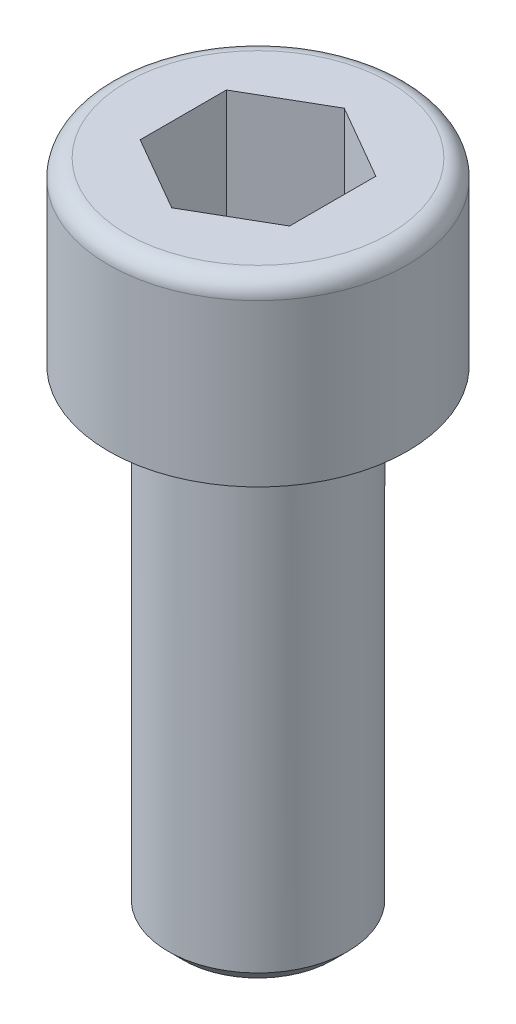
ISO-10303-21;
HEADER;
FILE_DESCRIPTION(('STEP AP214'),'2;1');
FILE_NAME('part.step','',(''),(''),'','','');
FILE_SCHEMA(('AUTOMOTIVE_DESIGN { 1 0 10303 214 1 1 1 1 }'));
ENDSEC;
DATA;
#1=APPLICATION_CONTEXT('core data for automotive mechanical design processes');
#2=APPLICATION_PROTOCOL_DEFINITION('international standard','automotive_design',2000,#1);
#3=PRODUCT_CONTEXT('',#1,'mechanical');
#4=PRODUCT('Part','Part','',(#3));
#5=PRODUCT_RELATED_PRODUCT_CATEGORY('part','',(#4));
#6=PRODUCT_DEFINITION_FORMATION('','',#4);
#7=PRODUCT_DEFINITION_CONTEXT('part definition',#1,'design');
#8=PRODUCT_DEFINITION('design','',#6,#7);
#9=PRODUCT_DEFINITION_SHAPE('','',#8);
#10=(LENGTH_UNIT() NAMED_UNIT(*) SI_UNIT(.MILLI.,.METRE.));
#11=(NAMED_UNIT(*) PLANE_ANGLE_UNIT() SI_UNIT($,.RADIAN.));
#12=(NAMED_UNIT(*) SI_UNIT($,.STERADIAN.) SOLID_ANGLE_UNIT());
#13=UNCERTAINTY_MEASURE_WITH_UNIT(LENGTH_MEASURE(1.E-05),#10,'distance_accuracy_value','');
#14=(GEOMETRIC_REPRESENTATION_CONTEXT(3) GLOBAL_UNCERTAINTY_ASSIGNED_CONTEXT((#13)) GLOBAL_UNIT_ASSIGNED_CONTEXT((#10,
#11,#12)) REPRESENTATION_CONTEXT('',''));
#15=CARTESIAN_POINT('',(0.,0.,0.));
#16=DIRECTION('',(0.,0.,1.));
#17=DIRECTION('',(1.,0.,0.));
#18=AXIS2_PLACEMENT_3D('',#15,#16,#17);
#19=CARTESIAN_POINT('',(2.99999999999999,-22.,0.));
#20=DIRECTION('',(0.,-1.,0.));
#21=DIRECTION('',(1.,0.,0.));
#22=AXIS2_PLACEMENT_3D('',#19,#20,#21);
#23=PLANE('',#22);
#24=CARTESIAN_POINT('',(0.,-22.,0.));
#25=DIRECTION('',(0.,-1.,0.));
#26=DIRECTION('',(1.,0.,0.));
#27=AXIS2_PLACEMENT_3D('',#24,#25,#26);
#28=CIRCLE('',#27,2.49999999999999);
#29=CARTESIAN_POINT('',(2.49999999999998,-22.,0.));
#30=VERTEX_POINT('',#29);
#31=EDGE_CURVE('E11',#30,#30,#28,.T.);
#32=ORIENTED_EDGE('',*,*,#31,.T.);
#33=EDGE_LOOP('',(#32));
#34=FACE_BOUND('',#33,.T.);
#35=ADVANCED_FACE('F35',(#34),#23,.T.);
#36=CARTESIAN_POINT('',(0.,65.1172922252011,0.));
#37=DIRECTION('',(0.,1.,0.));
#38=DIRECTION('',(-1.,0.,0.));
#39=AXIS2_PLACEMENT_3D('',#36,#37,#38);
#40=CYLINDRICAL_SURFACE('',#39,3.);
#41=CARTESIAN_POINT('',(0.,-21.5,0.));
#42=DIRECTION('',(0.,-1.,0.));
#43=DIRECTION('',(1.,0.,0.));
#44=AXIS2_PLACEMENT_3D('',#41,#42,#43);
#45=CIRCLE('',#44,3.);
#46=CARTESIAN_POINT('',(2.99999999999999,-21.5,0.));
#47=VERTEX_POINT('',#46);
#48=EDGE_CURVE('E42',#47,#47,#45,.F.);
#49=ORIENTED_EDGE('',*,*,#48,.T.);
#50=EDGE_LOOP('',(#49));
#51=FACE_BOUND('',#50,.T.);
#52=CARTESIAN_POINT('',(0.,-6.00000000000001,0.));
#53=DIRECTION('',(0.,1.,0.));
#54=DIRECTION('',(-1.,0.,0.));
#55=AXIS2_PLACEMENT_3D('',#52,#53,#54);
#56=CIRCLE('',#55,3.);
#57=CARTESIAN_POINT('',(-3.00000000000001,-6.00000000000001,0.));
#58=VERTEX_POINT('',#57);
#59=EDGE_CURVE('E150',#58,#58,#56,.T.);
#60=ORIENTED_EDGE('',*,*,#59,.F.);
#61=EDGE_LOOP('',(#60));
#62=FACE_BOUND('',#61,.T.);
#63=ADVANCED_FACE('F155',(#51,#62),#40,.T.);
#64=CARTESIAN_POINT('',(2.99999999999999,-6.,0.));
#65=DIRECTION('',(0.,1.,0.));
#66=DIRECTION('',(-1.,0.,0.));
#67=AXIS2_PLACEMENT_3D('',#64,#65,#66);
#68=PLANE('',#67);
#69=CARTESIAN_POINT('',(0.,-6.00000000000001,0.));
#70=DIRECTION('',(0.,1.,0.));
#71=DIRECTION('',(-1.,0.,0.));
#72=AXIS2_PLACEMENT_3D('',#69,#70,#71);
#73=CIRCLE('',#72,5.);
#74=CARTESIAN_POINT('',(-5.00000000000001,-6.,0.));
#75=VERTEX_POINT('',#74);
#76=EDGE_CURVE('E147',#75,#75,#73,.T.);
#77=ORIENTED_EDGE('',*,*,#76,.F.);
#78=EDGE_LOOP('',(#77));
#79=FACE_BOUND('',#78,.T.);
#80=ORIENTED_EDGE('',*,*,#59,.T.);
#81=EDGE_LOOP('',(#80));
#82=FACE_BOUND('',#81,.T.);
#83=ADVANCED_FACE('F179',(#79,#82),#68,.F.);
#84=CARTESIAN_POINT('',(0.,65.1172922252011,0.));
#85=DIRECTION('',(0.,1.,0.));
#86=DIRECTION('',(-1.,0.,0.));
#87=AXIS2_PLACEMENT_3D('',#84,#85,#86);
#88=CYLINDRICAL_SURFACE('',#87,5.);
#89=CARTESIAN_POINT('',(0.,-0.600000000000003,0.));
#90=DIRECTION('',(0.,1.,0.));
#91=DIRECTION('',(-1.,0.,0.));
#92=AXIS2_PLACEMENT_3D('',#89,#90,#91);
#93=CIRCLE('',#92,5.);
#94=CARTESIAN_POINT('',(-5.00000000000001,-0.600000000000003,0.));
#95=VERTEX_POINT('',#94);
#96=EDGE_CURVE('E144',#95,#95,#93,.T.);
#97=ORIENTED_EDGE('',*,*,#96,.F.);
#98=EDGE_LOOP('',(#97));
#99=FACE_BOUND('',#98,.T.);
#100=ORIENTED_EDGE('',*,*,#76,.T.);
#101=EDGE_LOOP('',(#100));
#102=FACE_BOUND('',#101,.T.);
#103=ADVANCED_FACE('F183',(#99,#102),#88,.T.);
#104=CARTESIAN_POINT('',(0.,-0.600000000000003,0.));
#105=DIRECTION('',(0.,1.,0.));
#106=DIRECTION('',(-1.,0.,0.));
#107=AXIS2_PLACEMENT_3D('',#104,#105,#106);
#108=TOROIDAL_SURFACE('',#107,4.4,0.6);
#109=CARTESIAN_POINT('',(0.,0.,0.));
#110=DIRECTION('',(0.,1.,0.));
#111=DIRECTION('',(-1.,0.,0.));
#112=AXIS2_PLACEMENT_3D('',#109,#110,#111);
#113=CIRCLE('',#112,4.4);
#114=CARTESIAN_POINT('',(-4.40000000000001,0.,0.));
#115=VERTEX_POINT('',#114);
#116=EDGE_CURVE('E141',#115,#115,#113,.T.);
#117=ORIENTED_EDGE('',*,*,#116,.F.);
#118=EDGE_LOOP('',(#117));
#119=FACE_BOUND('',#118,.T.);
#120=ORIENTED_EDGE('',*,*,#96,.T.);
#121=EDGE_LOOP('',(#120));
#122=FACE_BOUND('',#121,.T.);
#123=ADVANCED_FACE('F189',(#119,#122),#108,.T.);
#124=CARTESIAN_POINT('',(4.39999999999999,0.,0.));
#125=DIRECTION('',(0.,-1.,0.));
#126=DIRECTION('',(1.,0.,0.));
#127=AXIS2_PLACEMENT_3D('',#124,#125,#126);
#128=PLANE('',#127);
#129=DIRECTION('',(0.,0.,1.));
#130=VECTOR('',#129,1.);
#131=CARTESIAN_POINT('',(-2.5,0.,-1.44337567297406));
#132=LINE('',#131,#130);
#133=CARTESIAN_POINT('',(-2.5,0.,-1.44337567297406));
#134=VERTEX_POINT('',#133);
#135=CARTESIAN_POINT('',(-2.5,0.,1.44337567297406));
#136=VERTEX_POINT('',#135);
#137=EDGE_CURVE('E112',#134,#136,#132,.T.);
#138=ORIENTED_EDGE('',*,*,#137,.F.);
#139=DIRECTION('',(-0.866025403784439,0.,0.5));
#140=VECTOR('',#139,1.);
#141=CARTESIAN_POINT('',(0.,0.,-2.88675134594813));
#142=LINE('',#141,#140);
#143=CARTESIAN_POINT('',(0.,0.,-2.88675134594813));
#144=VERTEX_POINT('',#143);
#145=EDGE_CURVE('E49',#144,#134,#142,.T.);
#146=ORIENTED_EDGE('',*,*,#145,.F.);
#147=DIRECTION('',(0.866025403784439,0.,0.5));
#148=VECTOR('',#147,1.);
#149=CARTESIAN_POINT('',(0.,0.,-2.88675134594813));
#150=LINE('',#149,#148);
#151=CARTESIAN_POINT('',(2.5,0.,-1.44337567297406));
#152=VERTEX_POINT('',#151);
#153=EDGE_CURVE('E357',#144,#152,#150,.T.);
#154=ORIENTED_EDGE('',*,*,#153,.T.);
#155=DIRECTION('',(0.,0.,1.));
#156=VECTOR('',#155,1.);
#157=CARTESIAN_POINT('',(2.5,0.,-1.44337567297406));
#158=LINE('',#157,#156);
#159=CARTESIAN_POINT('',(2.5,0.,1.44337567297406));
#160=VERTEX_POINT('',#159);
#161=EDGE_CURVE('E354',#152,#160,#158,.T.);
#162=ORIENTED_EDGE('',*,*,#161,.T.);
#163=DIRECTION('',(-0.866025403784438,0.,0.5));
#164=VECTOR('',#163,1.);
#165=CARTESIAN_POINT('',(2.5,0.,1.44337567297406));
#166=LINE('',#165,#164);
#167=CARTESIAN_POINT('',(0.,0.,2.88675134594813));
#168=VERTEX_POINT('',#167);
#169=EDGE_CURVE('E351',#160,#168,#166,.T.);
#170=ORIENTED_EDGE('',*,*,#169,.T.);
#171=DIRECTION('',(0.866025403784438,0.,0.5));
#172=VECTOR('',#171,1.);
#173=CARTESIAN_POINT('',(-2.5,0.,1.44337567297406));
#174=LINE('',#173,#172);
#175=EDGE_CURVE('E349',#136,#168,#174,.T.);
#176=ORIENTED_EDGE('',*,*,#175,.F.);
#177=EDGE_LOOP('',(#138,#146,#154,#162,#170,#176));
#178=FACE_BOUND('',#177,.T.);
#179=ORIENTED_EDGE('',*,*,#116,.T.);
#180=EDGE_LOOP('',(#179));
#181=FACE_BOUND('',#180,.T.);
#182=ADVANCED_FACE('F193',(#178,#181),#128,.F.);
#183=CARTESIAN_POINT('',(0.,-4.32,-2.88675134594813));
#184=DIRECTION('',(-0.5,0.,-0.866025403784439));
#185=DIRECTION('',(-0.866025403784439,0.,0.5));
#186=AXIS2_PLACEMENT_3D('',#183,#184,#185);
#187=PLANE('',#186);
#188=DIRECTION('',(0.,1.,0.));
#189=VECTOR('',#188,1.);
#190=CARTESIAN_POINT('',(0.,-4.32,-2.88675134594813));
#191=LINE('',#190,#189);
#192=CARTESIAN_POINT('',(0.,-4.32,-2.88675134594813));
#193=VERTEX_POINT('',#192);
#194=EDGE_CURVE('E139',#193,#144,#191,.T.);
#195=ORIENTED_EDGE('',*,*,#194,.T.);
#196=ORIENTED_EDGE('',*,*,#145,.T.);
#197=DIRECTION('',(0.,1.,0.));
#198=VECTOR('',#197,1.);
#199=CARTESIAN_POINT('',(-2.5,-4.32,-1.44337567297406));
#200=LINE('',#199,#198);
#201=CARTESIAN_POINT('',(-2.5,-4.32,-1.44337567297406));
#202=VERTEX_POINT('',#201);
#203=EDGE_CURVE('E117',#202,#134,#200,.T.);
#204=ORIENTED_EDGE('',*,*,#203,.F.);
#205=DIRECTION('',(-0.866025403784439,0.,0.5));
#206=VECTOR('',#205,1.);
#207=CARTESIAN_POINT('',(0.,-4.32,-2.88675134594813));
#208=LINE('',#207,#206);
#209=EDGE_CURVE('E106',#193,#202,#208,.T.);
#210=ORIENTED_EDGE('',*,*,#209,.F.);
#211=EDGE_LOOP('',(#195,#196,#204,#210));
#212=FACE_BOUND('',#211,.T.);
#213=ADVANCED_FACE('F197',(#212),#187,.F.);
#214=CARTESIAN_POINT('',(0.,-4.32,-2.88675134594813));
#215=DIRECTION('',(-0.5,0.,0.866025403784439));
#216=DIRECTION('',(0.866025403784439,0.,0.5));
#217=AXIS2_PLACEMENT_3D('',#214,#215,#216);
#218=PLANE('',#217);
#219=DIRECTION('',(0.,1.,0.));
#220=VECTOR('',#219,1.);
#221=CARTESIAN_POINT('',(2.5,-4.32,-1.44337567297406));
#222=LINE('',#221,#220);
#223=CARTESIAN_POINT('',(2.5,-4.32,-1.44337567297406));
#224=VERTEX_POINT('',#223);
#225=EDGE_CURVE('E137',#224,#152,#222,.T.);
#226=ORIENTED_EDGE('',*,*,#225,.T.);
#227=ORIENTED_EDGE('',*,*,#153,.F.);
#228=ORIENTED_EDGE('',*,*,#194,.F.);
#229=DIRECTION('',(0.866025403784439,0.,0.5));
#230=VECTOR('',#229,1.);
#231=CARTESIAN_POINT('',(0.,-4.32,-2.88675134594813));
#232=LINE('',#231,#230);
#233=EDGE_CURVE('E130',#193,#224,#232,.T.);
#234=ORIENTED_EDGE('',*,*,#233,.T.);
#235=EDGE_LOOP('',(#226,#227,#228,#234));
#236=FACE_BOUND('',#235,.T.);
#237=ADVANCED_FACE('F199',(#236),#218,.T.);
#238=CARTESIAN_POINT('',(2.5,-4.32,-1.44337567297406));
#239=DIRECTION('',(-1.,0.,0.));
#240=DIRECTION('',(0.,-1.,0.));
#241=AXIS2_PLACEMENT_3D('',#238,#239,#240);
#242=PLANE('',#241);
#243=DIRECTION('',(0.,1.,0.));
#244=VECTOR('',#243,1.);
#245=CARTESIAN_POINT('',(2.5,-4.32,1.44337567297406));
#246=LINE('',#245,#244);
#247=CARTESIAN_POINT('',(2.5,-4.32,1.44337567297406));
#248=VERTEX_POINT('',#247);
#249=EDGE_CURVE('E135',#248,#160,#246,.T.);
#250=ORIENTED_EDGE('',*,*,#249,.T.);
#251=ORIENTED_EDGE('',*,*,#161,.F.);
#252=ORIENTED_EDGE('',*,*,#225,.F.);
#253=DIRECTION('',(0.,0.,1.));
#254=VECTOR('',#253,1.);
#255=CARTESIAN_POINT('',(2.5,-4.32,-1.44337567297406));
#256=LINE('',#255,#254);
#257=EDGE_CURVE('E124',#224,#248,#256,.T.);
#258=ORIENTED_EDGE('',*,*,#257,.T.);
#259=EDGE_LOOP('',(#250,#251,#252,#258));
#260=FACE_BOUND('',#259,.T.);
#261=ADVANCED_FACE('F202',(#260),#242,.T.);
#262=CARTESIAN_POINT('',(2.5,-4.32,1.44337567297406));
#263=DIRECTION('',(-0.5,0.,-0.866025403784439));
#264=DIRECTION('',(-0.866025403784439,0.,0.5));
#265=AXIS2_PLACEMENT_3D('',#262,#263,#264);
#266=PLANE('',#265);
#267=DIRECTION('',(0.,1.,0.));
#268=VECTOR('',#267,1.);
#269=CARTESIAN_POINT('',(0.,-4.32,2.88675134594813));
#270=LINE('',#269,#268);
#271=CARTESIAN_POINT('',(0.,-4.32,2.88675134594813));
#272=VERTEX_POINT('',#271);
#273=EDGE_CURVE('E116',#272,#168,#270,.T.);
#274=ORIENTED_EDGE('',*,*,#273,.T.);
#275=ORIENTED_EDGE('',*,*,#169,.F.);
#276=ORIENTED_EDGE('',*,*,#249,.F.);
#277=DIRECTION('',(-0.866025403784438,0.,0.5));
#278=VECTOR('',#277,1.);
#279=CARTESIAN_POINT('',(2.5,-4.32,1.44337567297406));
#280=LINE('',#279,#278);
#281=EDGE_CURVE('E122',#248,#272,#280,.T.);
#282=ORIENTED_EDGE('',*,*,#281,.T.);
#283=EDGE_LOOP('',(#274,#275,#276,#282));
#284=FACE_BOUND('',#283,.T.);
#285=ADVANCED_FACE('F206',(#284),#266,.T.);
#286=CARTESIAN_POINT('',(-2.5,-4.32,1.44337567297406));
#287=DIRECTION('',(-0.5,0.,0.866025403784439));
#288=DIRECTION('',(0.866025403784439,0.,0.5));
#289=AXIS2_PLACEMENT_3D('',#286,#287,#288);
#290=PLANE('',#289);
#291=DIRECTION('',(0.,1.,0.));
#292=VECTOR('',#291,1.);
#293=CARTESIAN_POINT('',(-2.5,-4.32,1.44337567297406));
#294=LINE('',#293,#292);
#295=CARTESIAN_POINT('',(-2.5,-4.32,1.44337567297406));
#296=VERTEX_POINT('',#295);
#297=EDGE_CURVE('E109',#296,#136,#294,.T.);
#298=ORIENTED_EDGE('',*,*,#297,.T.);
#299=ORIENTED_EDGE('',*,*,#175,.T.);
#300=ORIENTED_EDGE('',*,*,#273,.F.);
#301=DIRECTION('',(0.866025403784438,0.,0.5));
#302=VECTOR('',#301,1.);
#303=CARTESIAN_POINT('',(-2.5,-4.32,1.44337567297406));
#304=LINE('',#303,#302);
#305=EDGE_CURVE('E57',#296,#272,#304,.T.);
#306=ORIENTED_EDGE('',*,*,#305,.F.);
#307=EDGE_LOOP('',(#298,#299,#300,#306));
#308=FACE_BOUND('',#307,.T.);
#309=ADVANCED_FACE('F120',(#308),#290,.F.);
#310=CARTESIAN_POINT('',(-2.5,-4.32,-1.44337567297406));
#311=DIRECTION('',(-1.,0.,0.));
#312=DIRECTION('',(0.,-1.,0.));
#313=AXIS2_PLACEMENT_3D('',#310,#311,#312);
#314=PLANE('',#313);
#315=DIRECTION('',(0.,0.,1.));
#316=VECTOR('',#315,1.);
#317=CARTESIAN_POINT('',(-2.5,-4.32,-1.44337567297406));
#318=LINE('',#317,#316);
#319=EDGE_CURVE('E99',#202,#296,#318,.T.);
#320=ORIENTED_EDGE('',*,*,#319,.F.);
#321=ORIENTED_EDGE('',*,*,#203,.T.);
#322=ORIENTED_EDGE('',*,*,#137,.T.);
#323=ORIENTED_EDGE('',*,*,#297,.F.);
#324=EDGE_LOOP('',(#320,#321,#322,#323));
#325=FACE_BOUND('',#324,.T.);
#326=ADVANCED_FACE('F110',(#325),#314,.F.);
#327=CARTESIAN_POINT('',(-2.5,-4.32,-1.44337567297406));
#328=DIRECTION('',(0.0942779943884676,0.982062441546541,0.163294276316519));
#329=DIRECTION('',(0.,-0.164024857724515,0.986456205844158));
#330=AXIS2_PLACEMENT_3D('',#327,#328,#329);
#331=PLANE('',#330);
#332=DIRECTION('',(-0.854296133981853,0.164024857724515,-0.493228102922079));
#333=VECTOR('',#332,1.);
#334=CARTESIAN_POINT('',(0.,-4.8,0.));
#335=LINE('',#334,#333);
#336=CARTESIAN_POINT('',(0.,-4.8,0.));
#337=VERTEX_POINT('',#336);
#338=EDGE_CURVE('E103',#337,#202,#335,.T.);
#339=ORIENTED_EDGE('',*,*,#338,.F.);
#340=DIRECTION('',(0.,0.164024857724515,-0.986456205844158));
#341=VECTOR('',#340,1.);
#342=CARTESIAN_POINT('',(0.,-4.8,0.));
#343=LINE('',#342,#341);
#344=EDGE_CURVE('E342',#337,#193,#343,.T.);
#345=ORIENTED_EDGE('',*,*,#344,.T.);
#346=ORIENTED_EDGE('',*,*,#209,.T.);
#347=EDGE_LOOP('',(#339,#345,#346));
#348=FACE_BOUND('',#347,.T.);
#349=ADVANCED_FACE('F163',(#348),#331,.T.);
#350=CARTESIAN_POINT('',(0.,-4.32,-2.88675134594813));
#351=DIRECTION('',(-0.0942779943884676,0.982062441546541,0.163294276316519));
#352=DIRECTION('',(0.,-0.164024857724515,0.986456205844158));
#353=AXIS2_PLACEMENT_3D('',#350,#351,#352);
#354=PLANE('',#353);
#355=ORIENTED_EDGE('',*,*,#344,.F.);
#356=DIRECTION('',(0.854296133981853,0.164024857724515,-0.493228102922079));
#357=VECTOR('',#356,1.);
#358=CARTESIAN_POINT('',(0.,-4.8,0.));
#359=LINE('',#358,#357);
#360=EDGE_CURVE('E95',#337,#224,#359,.T.);
#361=ORIENTED_EDGE('',*,*,#360,.T.);
#362=ORIENTED_EDGE('',*,*,#233,.F.);
#363=EDGE_LOOP('',(#355,#361,#362));
#364=FACE_BOUND('',#363,.T.);
#365=ADVANCED_FACE('F171',(#364),#354,.T.);
#366=CARTESIAN_POINT('',(-2.5,-4.32,1.44337567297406));
#367=DIRECTION('',(0.188555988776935,0.982062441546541,0.));
#368=DIRECTION('',(-0.982062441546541,0.188555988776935,0.));
#369=AXIS2_PLACEMENT_3D('',#366,#367,#368);
#370=PLANE('',#369);
#371=DIRECTION('',(-0.854296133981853,0.164024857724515,0.493228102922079));
#372=VECTOR('',#371,1.);
#373=CARTESIAN_POINT('',(0.,-4.8,0.));
#374=LINE('',#373,#372);
#375=EDGE_CURVE('E89',#337,#296,#374,.T.);
#376=ORIENTED_EDGE('',*,*,#375,.F.);
#377=ORIENTED_EDGE('',*,*,#338,.T.);
#378=ORIENTED_EDGE('',*,*,#319,.T.);
#379=EDGE_LOOP('',(#376,#377,#378));
#380=FACE_BOUND('',#379,.T.);
#381=ADVANCED_FACE('F101',(#380),#370,.T.);
#382=CARTESIAN_POINT('',(2.5,-4.32,-1.44337567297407));
#383=DIRECTION('',(-0.188555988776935,0.982062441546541,0.));
#384=DIRECTION('',(-0.982062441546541,-0.188555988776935,0.));
#385=AXIS2_PLACEMENT_3D('',#382,#383,#384);
#386=PLANE('',#385);
#387=ORIENTED_EDGE('',*,*,#360,.F.);
#388=DIRECTION('',(0.854296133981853,0.164024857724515,0.493228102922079));
#389=VECTOR('',#388,1.);
#390=CARTESIAN_POINT('',(0.,-4.8,0.));
#391=LINE('',#390,#389);
#392=EDGE_CURVE('E96',#337,#248,#391,.T.);
#393=ORIENTED_EDGE('',*,*,#392,.T.);
#394=ORIENTED_EDGE('',*,*,#257,.F.);
#395=EDGE_LOOP('',(#387,#393,#394));
#396=FACE_BOUND('',#395,.T.);
#397=ADVANCED_FACE('F222',(#396),#386,.T.);
#398=CARTESIAN_POINT('',(0.,-4.32,2.88675134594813));
#399=DIRECTION('',(0.0942779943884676,0.98206244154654,-0.163294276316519));
#400=DIRECTION('',(0.,0.164024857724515,0.986456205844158));
#401=AXIS2_PLACEMENT_3D('',#398,#399,#400);
#402=PLANE('',#401);
#403=DIRECTION('',(0.,0.164024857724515,0.986456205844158));
#404=VECTOR('',#403,1.);
#405=CARTESIAN_POINT('',(0.,-4.8,0.));
#406=LINE('',#405,#404);
#407=EDGE_CURVE('E92',#337,#272,#406,.T.);
#408=ORIENTED_EDGE('',*,*,#407,.F.);
#409=ORIENTED_EDGE('',*,*,#375,.T.);
#410=ORIENTED_EDGE('',*,*,#305,.T.);
#411=EDGE_LOOP('',(#408,#409,#410));
#412=FACE_BOUND('',#411,.T.);
#413=ADVANCED_FACE('F91',(#412),#402,.T.);
#414=CARTESIAN_POINT('',(2.5,-4.32,1.44337567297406));
#415=DIRECTION('',(-0.0942779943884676,0.98206244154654,-0.163294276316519));
#416=DIRECTION('',(0.,0.164024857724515,0.986456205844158));
#417=AXIS2_PLACEMENT_3D('',#414,#415,#416);
#418=PLANE('',#417);
#419=ORIENTED_EDGE('',*,*,#392,.F.);
#420=ORIENTED_EDGE('',*,*,#407,.T.);
#421=ORIENTED_EDGE('',*,*,#281,.F.);
#422=EDGE_LOOP('',(#419,#420,#421));
#423=FACE_BOUND('',#422,.T.);
#424=ADVANCED_FACE('F160',(#423),#418,.T.);
#425=CARTESIAN_POINT('',(0.,-21.5,0.));
#426=DIRECTION('',(0.,1.,0.));
#427=DIRECTION('',(-1.,0.,0.));
#428=AXIS2_PLACEMENT_3D('',#425,#426,#427);
#429=CONICAL_SURFACE('',#428,3.,0.785398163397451);
#430=ORIENTED_EDGE('',*,*,#31,.F.);
#431=EDGE_LOOP('',(#430));
#432=FACE_BOUND('',#431,.T.);
#433=ORIENTED_EDGE('',*,*,#48,.F.);
#434=EDGE_LOOP('',(#433));
#435=FACE_BOUND('',#434,.T.);
#436=ADVANCED_FACE('F158',(#432,#435),#429,.T.);
#437=CLOSED_SHELL('',(#35,#63,#83,#103,#123,#182,#213,#237,#261,#285,#309,#326,#349,#365,#381,
#397,#413,#424,#436));
#438=MANIFOLD_SOLID_BREP('B2',#437);
#439=ADVANCED_BREP_SHAPE_REPRESENTATION('',(#18,#438),#14);
#440=SHAPE_DEFINITION_REPRESENTATION(#9,#439);
ENDSEC;
END-ISO-10303-21;
